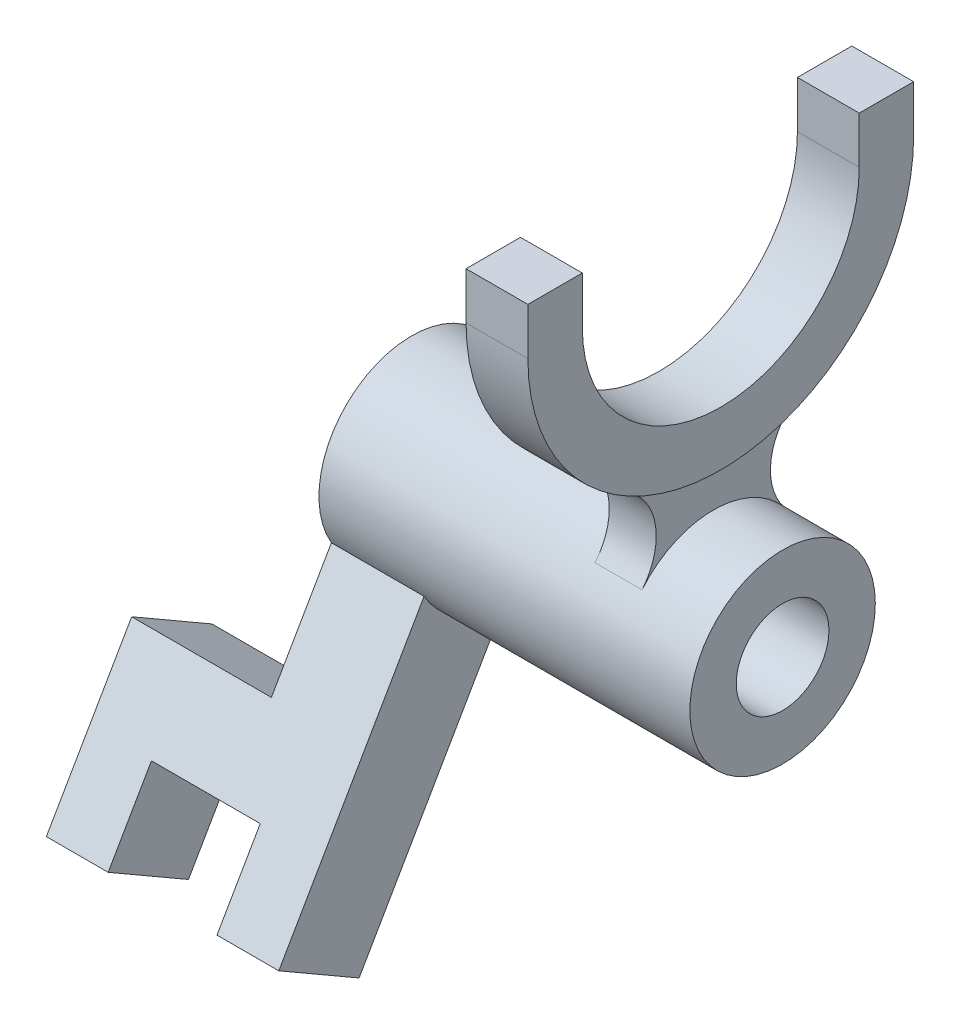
ISO-10303-21;
HEADER;
FILE_DESCRIPTION(('STEP AP214'),'2;1');
FILE_NAME('part.step','',(''),(''),'','','');
FILE_SCHEMA(('AUTOMOTIVE_DESIGN { 1 0 10303 214 1 1 1 1 }'));
ENDSEC;
DATA;
#1=APPLICATION_CONTEXT('core data for automotive mechanical design processes');
#2=APPLICATION_PROTOCOL_DEFINITION('international standard','automotive_design',2000,#1);
#3=PRODUCT_CONTEXT('',#1,'mechanical');
#4=PRODUCT('Part','Part','',(#3));
#5=PRODUCT_RELATED_PRODUCT_CATEGORY('part','',(#4));
#6=PRODUCT_DEFINITION_FORMATION('','',#4);
#7=PRODUCT_DEFINITION_CONTEXT('part definition',#1,'design');
#8=PRODUCT_DEFINITION('design','',#6,#7);
#9=PRODUCT_DEFINITION_SHAPE('','',#8);
#10=(LENGTH_UNIT() NAMED_UNIT(*) SI_UNIT(.MILLI.,.METRE.));
#11=(NAMED_UNIT(*) PLANE_ANGLE_UNIT() SI_UNIT($,.RADIAN.));
#12=(NAMED_UNIT(*) SI_UNIT($,.STERADIAN.) SOLID_ANGLE_UNIT());
#13=UNCERTAINTY_MEASURE_WITH_UNIT(LENGTH_MEASURE(1.E-05),#10,'distance_accuracy_value','');
#14=(GEOMETRIC_REPRESENTATION_CONTEXT(3) GLOBAL_UNCERTAINTY_ASSIGNED_CONTEXT((#13)) GLOBAL_UNIT_ASSIGNED_CONTEXT((#10,
#11,#12)) REPRESENTATION_CONTEXT('',''));
#15=CARTESIAN_POINT('',(0.,0.,0.));
#16=DIRECTION('',(0.,0.,1.));
#17=DIRECTION('',(1.,0.,0.));
#18=AXIS2_PLACEMENT_3D('',#15,#16,#17);
#19=CARTESIAN_POINT('',(-57.15,0.,0.));
#20=DIRECTION('',(1.,0.,0.));
#21=DIRECTION('',(0.,0.,-1.));
#22=AXIS2_PLACEMENT_3D('',#19,#20,#21);
#23=CYLINDRICAL_SURFACE('',#22,19.05);
#24=DIRECTION('',(1.,0.,0.));
#25=VECTOR('',#24,1.);
#26=CARTESIAN_POINT('',(-57.15,-9.52499999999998,16.4977839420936));
#27=LINE('',#26,#25);
#28=CARTESIAN_POINT('',(-38.1,-9.52499999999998,16.4977839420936));
#29=VERTEX_POINT('',#28);
#30=CARTESIAN_POINT('',(-57.15,-9.52499999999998,16.4977839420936));
#31=VERTEX_POINT('',#30);
#32=EDGE_CURVE('E190',#29,#31,#27,.F.);
#33=ORIENTED_EDGE('',*,*,#32,.F.);
#34=CARTESIAN_POINT('',(-38.1,0.,0.));
#35=DIRECTION('',(-1.,0.,0.));
#36=DIRECTION('',(0.,-1.,0.));
#37=AXIS2_PLACEMENT_3D('',#34,#35,#36);
#38=CIRCLE('',#37,19.05);
#39=CARTESIAN_POINT('',(-38.1,-19.05,0.));
#40=VERTEX_POINT('',#39);
#41=EDGE_CURVE('E199',#29,#40,#38,.F.);
#42=ORIENTED_EDGE('',*,*,#41,.T.);
#43=DIRECTION('',(1.,0.,0.));
#44=VECTOR('',#43,1.);
#45=CARTESIAN_POINT('',(-57.15,-19.05,0.));
#46=LINE('',#45,#44);
#47=CARTESIAN_POINT('',(-57.15,-19.05,0.));
#48=VERTEX_POINT('',#47);
#49=EDGE_CURVE('E259',#40,#48,#46,.F.);
#50=ORIENTED_EDGE('',*,*,#49,.T.);
#51=CARTESIAN_POINT('',(-57.15,0.,0.));
#52=DIRECTION('',(1.,0.,0.));
#53=DIRECTION('',(0.,0.,-1.));
#54=AXIS2_PLACEMENT_3D('',#51,#52,#53);
#55=CIRCLE('',#54,19.05);
#56=EDGE_CURVE('E11',#48,#31,#55,.T.);
#57=ORIENTED_EDGE('',*,*,#56,.T.);
#58=EDGE_LOOP('',(#33,#42,#50,#57));
#59=FACE_BOUND('',#58,.T.);
#60=CARTESIAN_POINT('',(4.826,0.,0.));
#61=DIRECTION('',(-1.,0.,0.));
#62=DIRECTION('',(0.,0.,-1.));
#63=AXIS2_PLACEMENT_3D('',#60,#61,#62);
#64=CIRCLE('',#63,19.05);
#65=CARTESIAN_POINT('',(4.826,12.1666969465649,14.6585806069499));
#66=VERTEX_POINT('',#65);
#67=CARTESIAN_POINT('',(4.826,12.1666969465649,-14.6585806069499));
#68=VERTEX_POINT('',#67);
#69=EDGE_CURVE('E326',#66,#68,#64,.T.);
#70=ORIENTED_EDGE('',*,*,#69,.F.);
#71=DIRECTION('',(-1.,0.,0.));
#72=VECTOR('',#71,1.);
#73=CARTESIAN_POINT('',(4.826,12.1666969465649,14.6585806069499));
#74=LINE('',#73,#72);
#75=CARTESIAN_POINT('',(-4.826,12.1666969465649,14.6585806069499));
#76=VERTEX_POINT('',#75);
#77=EDGE_CURVE('E349',#66,#76,#74,.T.);
#78=ORIENTED_EDGE('',*,*,#77,.T.);
#79=CARTESIAN_POINT('',(-4.826,0.,0.));
#80=DIRECTION('',(-1.,0.,0.));
#81=DIRECTION('',(0.,0.,-1.));
#82=AXIS2_PLACEMENT_3D('',#79,#80,#81);
#83=CIRCLE('',#82,19.05);
#84=CARTESIAN_POINT('',(-4.826,12.1666969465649,-14.6585806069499));
#85=VERTEX_POINT('',#84);
#86=EDGE_CURVE('E336',#76,#85,#83,.T.);
#87=ORIENTED_EDGE('',*,*,#86,.T.);
#88=DIRECTION('',(-1.,0.,0.));
#89=VECTOR('',#88,1.);
#90=CARTESIAN_POINT('',(4.826,12.1666969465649,-14.6585806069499));
#91=LINE('',#90,#89);
#92=EDGE_CURVE('E347',#68,#85,#91,.T.);
#93=ORIENTED_EDGE('',*,*,#92,.F.);
#94=EDGE_LOOP('',(#70,#78,#87,#93));
#95=FACE_BOUND('',#94,.T.);
#96=CARTESIAN_POINT('',(19.05,0.,0.));
#97=DIRECTION('',(1.,0.,0.));
#98=DIRECTION('',(0.,0.,-1.));
#99=AXIS2_PLACEMENT_3D('',#96,#97,#98);
#100=CIRCLE('',#99,19.05);
#101=CARTESIAN_POINT('',(19.05,0.,-19.05));
#102=VERTEX_POINT('',#101);
#103=EDGE_CURVE('E355',#102,#102,#100,.T.);
#104=ORIENTED_EDGE('',*,*,#103,.F.);
#105=EDGE_LOOP('',(#104));
#106=FACE_BOUND('',#105,.T.);
#107=ADVANCED_FACE('F35',(#59,#95,#106),#23,.T.);
#108=CARTESIAN_POINT('',(-57.15,0.,0.));
#109=DIRECTION('',(1.,0.,0.));
#110=DIRECTION('',(0.,0.,-1.));
#111=AXIS2_PLACEMENT_3D('',#108,#109,#110);
#112=PLANE('',#111);
#113=CARTESIAN_POINT('',(-57.15,0.,0.));
#114=DIRECTION('',(1.,0.,0.));
#115=DIRECTION('',(0.,0.,-1.));
#116=AXIS2_PLACEMENT_3D('',#113,#114,#115);
#117=CIRCLE('',#116,9.525);
#118=CARTESIAN_POINT('',(-57.15,0.,-9.525));
#119=VERTEX_POINT('',#118);
#120=EDGE_CURVE('E42',#119,#119,#117,.T.);
#121=ORIENTED_EDGE('',*,*,#120,.T.);
#122=EDGE_LOOP('',(#121));
#123=FACE_BOUND('',#122,.T.);
#124=ORIENTED_EDGE('',*,*,#56,.F.);
#125=DIRECTION('',(0.,-0.866025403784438,0.500000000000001));
#126=VECTOR('',#125,1.);
#127=CARTESIAN_POINT('',(-57.15,-13.0113919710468,-3.48639197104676));
#128=LINE('',#127,#126);
#129=CARTESIAN_POINT('',(-57.15,-40.3977133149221,12.3251080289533));
#130=VERTEX_POINT('',#129);
#131=EDGE_CURVE('E49',#48,#130,#128,.T.);
#132=ORIENTED_EDGE('',*,*,#131,.T.);
#133=DIRECTION('',(0.,-0.500000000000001,-0.866025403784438));
#134=VECTOR('',#133,1.);
#135=CARTESIAN_POINT('',(-57.15,-30.872713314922,28.8228919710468));
#136=LINE('',#135,#134);
#137=CARTESIAN_POINT('',(-57.15,-30.872713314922,28.8228919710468));
#138=VERTEX_POINT('',#137);
#139=EDGE_CURVE('E196',#138,#130,#136,.T.);
#140=ORIENTED_EDGE('',*,*,#139,.F.);
#141=DIRECTION('',(0.,-0.866025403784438,0.500000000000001));
#142=VECTOR('',#141,1.);
#143=CARTESIAN_POINT('',(-57.15,-3.48639197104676,13.0113919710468));
#144=LINE('',#143,#142);
#145=EDGE_CURVE('E182',#31,#138,#144,.T.);
#146=ORIENTED_EDGE('',*,*,#145,.F.);
#147=EDGE_LOOP('',(#124,#132,#140,#146));
#148=FACE_BOUND('',#147,.T.);
#149=ADVANCED_FACE('F197',(#123,#148),#112,.F.);
#150=CARTESIAN_POINT('',(-57.15,0.,0.));
#151=DIRECTION('',(1.,0.,0.));
#152=DIRECTION('',(0.,0.,-1.));
#153=AXIS2_PLACEMENT_3D('',#150,#151,#152);
#154=CYLINDRICAL_SURFACE('',#153,9.525);
#155=ORIENTED_EDGE('',*,*,#120,.F.);
#156=EDGE_LOOP('',(#155));
#157=FACE_BOUND('',#156,.T.);
#158=CARTESIAN_POINT('',(19.05,0.,0.));
#159=DIRECTION('',(1.,0.,0.));
#160=DIRECTION('',(0.,0.,-1.));
#161=AXIS2_PLACEMENT_3D('',#158,#159,#160);
#162=CIRCLE('',#161,9.525);
#163=CARTESIAN_POINT('',(19.05,0.,-9.525));
#164=VERTEX_POINT('',#163);
#165=EDGE_CURVE('E352',#164,#164,#162,.T.);
#166=ORIENTED_EDGE('',*,*,#165,.T.);
#167=EDGE_LOOP('',(#166));
#168=FACE_BOUND('',#167,.T.);
#169=ADVANCED_FACE('F361',(#157,#168),#154,.F.);
#170=CARTESIAN_POINT('',(19.05,0.,0.));
#171=DIRECTION('',(1.,0.,0.));
#172=DIRECTION('',(0.,0.,-1.));
#173=AXIS2_PLACEMENT_3D('',#170,#171,#172);
#174=PLANE('',#173);
#175=ORIENTED_EDGE('',*,*,#103,.T.);
#176=EDGE_LOOP('',(#175));
#177=FACE_BOUND('',#176,.T.);
#178=ORIENTED_EDGE('',*,*,#165,.F.);
#179=EDGE_LOOP('',(#178));
#180=FACE_BOUND('',#179,.T.);
#181=ADVANCED_FACE('F364',(#177,#180),#174,.T.);
#182=CARTESIAN_POINT('',(4.826,20.2778282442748,24.4309676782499));
#183=DIRECTION('',(-1.,0.,0.));
#184=DIRECTION('',(0.,0.,1.));
#185=AXIS2_PLACEMENT_3D('',#182,#183,#184);
#186=CYLINDRICAL_SURFACE('',#185,12.7);
#187=CARTESIAN_POINT('',(-4.826,20.2778282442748,24.4309676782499));
#188=DIRECTION('',(-1.,0.,0.));
#189=DIRECTION('',(0.,0.,-1.));
#190=AXIS2_PLACEMENT_3D('',#187,#188,#189);
#191=CIRCLE('',#190,12.7);
#192=CARTESIAN_POINT('',(-4.826,31.5084524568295,18.5011211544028));
#193=VERTEX_POINT('',#192);
#194=EDGE_CURVE('E323',#193,#76,#191,.T.);
#195=ORIENTED_EDGE('',*,*,#194,.T.);
#196=ORIENTED_EDGE('',*,*,#77,.F.);
#197=CARTESIAN_POINT('',(4.826,20.2778282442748,24.4309676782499));
#198=DIRECTION('',(-1.,0.,0.));
#199=DIRECTION('',(0.,0.,-1.));
#200=AXIS2_PLACEMENT_3D('',#197,#198,#199);
#201=CIRCLE('',#200,12.7);
#202=CARTESIAN_POINT('',(4.826,31.5084524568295,18.5011211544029));
#203=VERTEX_POINT('',#202);
#204=EDGE_CURVE('E324',#203,#66,#201,.T.);
#205=ORIENTED_EDGE('',*,*,#204,.F.);
#206=DIRECTION('',(-1.,0.,0.));
#207=VECTOR('',#206,1.);
#208=CARTESIAN_POINT('',(4.826,31.5084524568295,18.5011211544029));
#209=LINE('',#208,#207);
#210=EDGE_CURVE('E333',#203,#193,#209,.T.);
#211=ORIENTED_EDGE('',*,*,#210,.T.);
#212=EDGE_LOOP('',(#195,#196,#205,#211));
#213=FACE_BOUND('',#212,.T.);
#214=ADVANCED_FACE('F369',(#213),#186,.F.);
#215=CARTESIAN_POINT('',(4.826,20.2778282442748,-24.4309676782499));
#216=DIRECTION('',(-1.,0.,0.));
#217=DIRECTION('',(0.,0.,1.));
#218=AXIS2_PLACEMENT_3D('',#215,#216,#217);
#219=CYLINDRICAL_SURFACE('',#218,12.7);
#220=CARTESIAN_POINT('',(-4.826,20.2778282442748,-24.4309676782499));
#221=DIRECTION('',(-1.,0.,0.));
#222=DIRECTION('',(0.,0.,1.));
#223=AXIS2_PLACEMENT_3D('',#220,#221,#222);
#224=CIRCLE('',#223,12.7);
#225=CARTESIAN_POINT('',(-4.826,31.5084524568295,-18.5011211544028));
#226=VERTEX_POINT('',#225);
#227=EDGE_CURVE('E57',#85,#226,#224,.T.);
#228=ORIENTED_EDGE('',*,*,#227,.T.);
#229=DIRECTION('',(-1.,0.,0.));
#230=VECTOR('',#229,1.);
#231=CARTESIAN_POINT('',(4.826,31.5084524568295,-18.5011211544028));
#232=LINE('',#231,#230);
#233=CARTESIAN_POINT('',(4.826,31.5084524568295,-18.5011211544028));
#234=VERTEX_POINT('',#233);
#235=EDGE_CURVE('E344',#234,#226,#232,.T.);
#236=ORIENTED_EDGE('',*,*,#235,.F.);
#237=CARTESIAN_POINT('',(4.826,20.2778282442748,-24.4309676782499));
#238=DIRECTION('',(-1.,0.,0.));
#239=DIRECTION('',(0.,0.,1.));
#240=AXIS2_PLACEMENT_3D('',#237,#238,#239);
#241=CIRCLE('',#240,12.7);
#242=EDGE_CURVE('E329',#68,#234,#241,.T.);
#243=ORIENTED_EDGE('',*,*,#242,.F.);
#244=ORIENTED_EDGE('',*,*,#92,.T.);
#245=EDGE_LOOP('',(#228,#236,#243,#244));
#246=FACE_BOUND('',#245,.T.);
#247=ADVANCED_FACE('F376',(#246),#219,.F.);
#248=CARTESIAN_POINT('',(4.826,43.4129141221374,12.2154838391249));
#249=DIRECTION('',(1.,0.,0.));
#250=DIRECTION('',(0.,0.,-1.));
#251=AXIS2_PLACEMENT_3D('',#248,#249,#250);
#252=PLANE('',#251);
#253=ORIENTED_EDGE('',*,*,#204,.T.);
#254=ORIENTED_EDGE('',*,*,#69,.T.);
#255=ORIENTED_EDGE('',*,*,#242,.T.);
#256=CARTESIAN_POINT('',(4.826,66.548,0.));
#257=DIRECTION('',(-1.,0.,0.));
#258=DIRECTION('',(0.,0.,-1.));
#259=AXIS2_PLACEMENT_3D('',#256,#257,#258);
#260=CIRCLE('',#259,39.624);
#261=EDGE_CURVE('E331',#234,#203,#260,.T.);
#262=ORIENTED_EDGE('',*,*,#261,.T.);
#263=EDGE_LOOP('',(#253,#254,#255,#262));
#264=FACE_BOUND('',#263,.T.);
#265=ADVANCED_FACE('F394',(#264),#252,.T.);
#266=CARTESIAN_POINT('',(-4.826,43.4129141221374,12.2154838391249));
#267=DIRECTION('',(1.,0.,0.));
#268=DIRECTION('',(0.,0.,-1.));
#269=AXIS2_PLACEMENT_3D('',#266,#267,#268);
#270=PLANE('',#269);
#271=ORIENTED_EDGE('',*,*,#194,.F.);
#272=CARTESIAN_POINT('',(-4.826,66.548,0.));
#273=DIRECTION('',(-1.,0.,0.));
#274=DIRECTION('',(0.,0.,-1.));
#275=AXIS2_PLACEMENT_3D('',#272,#273,#274);
#276=CIRCLE('',#275,39.624);
#277=EDGE_CURVE('E327',#226,#193,#276,.T.);
#278=ORIENTED_EDGE('',*,*,#277,.F.);
#279=ORIENTED_EDGE('',*,*,#227,.F.);
#280=ORIENTED_EDGE('',*,*,#86,.F.);
#281=EDGE_LOOP('',(#271,#278,#279,#280));
#282=FACE_BOUND('',#281,.T.);
#283=ADVANCED_FACE('F403',(#282),#270,.F.);
#284=CARTESIAN_POINT('',(6.35,66.548,28.448));
#285=DIRECTION('',(0.,0.,1.));
#286=DIRECTION('',(1.,0.,0.));
#287=AXIS2_PLACEMENT_3D('',#284,#285,#286);
#288=PLANE('',#287);
#289=DIRECTION('',(0.,1.,0.));
#290=VECTOR('',#289,1.);
#291=CARTESIAN_POINT('',(-6.35,66.548,28.448));
#292=LINE('',#291,#290);
#293=CARTESIAN_POINT('',(-6.35,66.548,28.448));
#294=VERTEX_POINT('',#293);
#295=CARTESIAN_POINT('',(-6.35,76.2,28.448));
#296=VERTEX_POINT('',#295);
#297=EDGE_CURVE('E262',#294,#296,#292,.T.);
#298=ORIENTED_EDGE('',*,*,#297,.T.);
#299=DIRECTION('',(-1.,0.,0.));
#300=VECTOR('',#299,1.);
#301=CARTESIAN_POINT('',(6.35,76.2,28.448));
#302=LINE('',#301,#300);
#303=CARTESIAN_POINT('',(6.35,76.2,28.448));
#304=VERTEX_POINT('',#303);
#305=EDGE_CURVE('E321',#304,#296,#302,.T.);
#306=ORIENTED_EDGE('',*,*,#305,.F.);
#307=DIRECTION('',(0.,1.,0.));
#308=VECTOR('',#307,1.);
#309=CARTESIAN_POINT('',(6.35,66.548,28.448));
#310=LINE('',#309,#308);
#311=CARTESIAN_POINT('',(6.35,66.548,28.448));
#312=VERTEX_POINT('',#311);
#313=EDGE_CURVE('E263',#312,#304,#310,.T.);
#314=ORIENTED_EDGE('',*,*,#313,.F.);
#315=DIRECTION('',(-1.,0.,0.));
#316=VECTOR('',#315,1.);
#317=CARTESIAN_POINT('',(6.35,66.548,28.448));
#318=LINE('',#317,#316);
#319=EDGE_CURVE('E285',#312,#294,#318,.T.);
#320=ORIENTED_EDGE('',*,*,#319,.T.);
#321=EDGE_LOOP('',(#298,#306,#314,#320));
#322=FACE_BOUND('',#321,.T.);
#323=ADVANCED_FACE('F405',(#322),#288,.F.);
#324=CARTESIAN_POINT('',(6.35,76.2,39.624));
#325=DIRECTION('',(0.,1.,0.));
#326=DIRECTION('',(0.,0.,1.));
#327=AXIS2_PLACEMENT_3D('',#324,#325,#326);
#328=PLANE('',#327);
#329=DIRECTION('',(0.,0.,-1.));
#330=VECTOR('',#329,1.);
#331=CARTESIAN_POINT('',(-6.35,76.2,39.624));
#332=LINE('',#331,#330);
#333=CARTESIAN_POINT('',(-6.35,76.2,39.624));
#334=VERTEX_POINT('',#333);
#335=EDGE_CURVE('E288',#334,#296,#332,.T.);
#336=ORIENTED_EDGE('',*,*,#335,.F.);
#337=DIRECTION('',(-1.,0.,0.));
#338=VECTOR('',#337,1.);
#339=CARTESIAN_POINT('',(6.35,76.2,39.624));
#340=LINE('',#339,#338);
#341=CARTESIAN_POINT('',(6.35,76.2,39.624));
#342=VERTEX_POINT('',#341);
#343=EDGE_CURVE('E319',#342,#334,#340,.T.);
#344=ORIENTED_EDGE('',*,*,#343,.F.);
#345=DIRECTION('',(0.,0.,-1.));
#346=VECTOR('',#345,1.);
#347=CARTESIAN_POINT('',(6.35,76.2,39.624));
#348=LINE('',#347,#346);
#349=EDGE_CURVE('E265',#342,#304,#348,.T.);
#350=ORIENTED_EDGE('',*,*,#349,.T.);
#351=ORIENTED_EDGE('',*,*,#305,.T.);
#352=EDGE_LOOP('',(#336,#344,#350,#351));
#353=FACE_BOUND('',#352,.T.);
#354=ADVANCED_FACE('F411',(#353),#328,.T.);
#355=CARTESIAN_POINT('',(6.35,66.548,39.624));
#356=DIRECTION('',(0.,0.,1.));
#357=DIRECTION('',(1.,0.,0.));
#358=AXIS2_PLACEMENT_3D('',#355,#356,#357);
#359=PLANE('',#358);
#360=DIRECTION('',(0.,1.,0.));
#361=VECTOR('',#360,1.);
#362=CARTESIAN_POINT('',(-6.35,66.548,39.624));
#363=LINE('',#362,#361);
#364=CARTESIAN_POINT('',(-6.35,66.548,39.624));
#365=VERTEX_POINT('',#364);
#366=EDGE_CURVE('E291',#365,#334,#363,.T.);
#367=ORIENTED_EDGE('',*,*,#366,.F.);
#368=DIRECTION('',(-1.,0.,0.));
#369=VECTOR('',#368,1.);
#370=CARTESIAN_POINT('',(6.35,66.548,39.624));
#371=LINE('',#370,#369);
#372=CARTESIAN_POINT('',(6.35,66.548,39.624));
#373=VERTEX_POINT('',#372);
#374=EDGE_CURVE('E317',#373,#365,#371,.T.);
#375=ORIENTED_EDGE('',*,*,#374,.F.);
#376=DIRECTION('',(0.,1.,0.));
#377=VECTOR('',#376,1.);
#378=CARTESIAN_POINT('',(6.35,66.548,39.624));
#379=LINE('',#378,#377);
#380=EDGE_CURVE('E269',#373,#342,#379,.T.);
#381=ORIENTED_EDGE('',*,*,#380,.T.);
#382=ORIENTED_EDGE('',*,*,#343,.T.);
#383=EDGE_LOOP('',(#367,#375,#381,#382));
#384=FACE_BOUND('',#383,.T.);
#385=ADVANCED_FACE('F446',(#384),#359,.T.);
#386=CARTESIAN_POINT('',(6.35,66.548,0.));
#387=DIRECTION('',(-1.,0.,0.));
#388=DIRECTION('',(0.,0.,1.));
#389=AXIS2_PLACEMENT_3D('',#386,#387,#388);
#390=CYLINDRICAL_SURFACE('',#389,39.624);
#391=ORIENTED_EDGE('',*,*,#210,.F.);
#392=ORIENTED_EDGE('',*,*,#261,.F.);
#393=ORIENTED_EDGE('',*,*,#235,.T.);
#394=ORIENTED_EDGE('',*,*,#277,.T.);
#395=EDGE_LOOP('',(#391,#392,#393,#394));
#396=FACE_BOUND('',#395,.T.);
#397=CARTESIAN_POINT('',(-6.35,66.548,0.));
#398=DIRECTION('',(-1.,0.,0.));
#399=DIRECTION('',(0.,0.,-1.));
#400=AXIS2_PLACEMENT_3D('',#397,#398,#399);
#401=CIRCLE('',#400,39.624);
#402=CARTESIAN_POINT('',(-6.35,66.548,-39.624));
#403=VERTEX_POINT('',#402);
#404=EDGE_CURVE('E294',#403,#365,#401,.T.);
#405=ORIENTED_EDGE('',*,*,#404,.F.);
#406=DIRECTION('',(-1.,0.,0.));
#407=VECTOR('',#406,1.);
#408=CARTESIAN_POINT('',(6.35,66.548,-39.624));
#409=LINE('',#408,#407);
#410=CARTESIAN_POINT('',(6.35,66.548,-39.624));
#411=VERTEX_POINT('',#410);
#412=EDGE_CURVE('E315',#411,#403,#409,.T.);
#413=ORIENTED_EDGE('',*,*,#412,.F.);
#414=CARTESIAN_POINT('',(6.35,66.548,0.));
#415=DIRECTION('',(-1.,0.,0.));
#416=DIRECTION('',(0.,0.,-1.));
#417=AXIS2_PLACEMENT_3D('',#414,#415,#416);
#418=CIRCLE('',#417,39.624);
#419=EDGE_CURVE('E272',#411,#373,#418,.T.);
#420=ORIENTED_EDGE('',*,*,#419,.T.);
#421=ORIENTED_EDGE('',*,*,#374,.T.);
#422=EDGE_LOOP('',(#405,#413,#420,#421));
#423=FACE_BOUND('',#422,.T.);
#424=ADVANCED_FACE('F401',(#396,#423),#390,.T.);
#425=CARTESIAN_POINT('',(6.35,66.548,-39.624));
#426=DIRECTION('',(0.,0.,-1.));
#427=DIRECTION('',(-1.,0.,0.));
#428=AXIS2_PLACEMENT_3D('',#425,#426,#427);
#429=PLANE('',#428);
#430=DIRECTION('',(0.,-1.,0.));
#431=VECTOR('',#430,1.);
#432=CARTESIAN_POINT('',(-6.35,66.548,-39.624));
#433=LINE('',#432,#431);
#434=CARTESIAN_POINT('',(-6.35,76.2,-39.624));
#435=VERTEX_POINT('',#434);
#436=EDGE_CURVE('E297',#435,#403,#433,.T.);
#437=ORIENTED_EDGE('',*,*,#436,.F.);
#438=DIRECTION('',(-1.,0.,0.));
#439=VECTOR('',#438,1.);
#440=CARTESIAN_POINT('',(6.35,76.2,-39.624));
#441=LINE('',#440,#439);
#442=CARTESIAN_POINT('',(6.35,76.2,-39.624));
#443=VERTEX_POINT('',#442);
#444=EDGE_CURVE('E313',#443,#435,#441,.T.);
#445=ORIENTED_EDGE('',*,*,#444,.F.);
#446=DIRECTION('',(0.,-1.,0.));
#447=VECTOR('',#446,1.);
#448=CARTESIAN_POINT('',(6.35,66.548,-39.624));
#449=LINE('',#448,#447);
#450=EDGE_CURVE('E275',#443,#411,#449,.T.);
#451=ORIENTED_EDGE('',*,*,#450,.T.);
#452=ORIENTED_EDGE('',*,*,#412,.T.);
#453=EDGE_LOOP('',(#437,#445,#451,#452));
#454=FACE_BOUND('',#453,.T.);
#455=ADVANCED_FACE('F465',(#454),#429,.T.);
#456=CARTESIAN_POINT('',(6.35,76.2,-28.448));
#457=DIRECTION('',(0.,1.,0.));
#458=DIRECTION('',(0.,0.,1.));
#459=AXIS2_PLACEMENT_3D('',#456,#457,#458);
#460=PLANE('',#459);
#461=DIRECTION('',(0.,0.,-1.));
#462=VECTOR('',#461,1.);
#463=CARTESIAN_POINT('',(-6.35,76.2,-28.448));
#464=LINE('',#463,#462);
#465=CARTESIAN_POINT('',(-6.35,76.2,-28.448));
#466=VERTEX_POINT('',#465);
#467=EDGE_CURVE('E300',#466,#435,#464,.T.);
#468=ORIENTED_EDGE('',*,*,#467,.F.);
#469=DIRECTION('',(-1.,0.,0.));
#470=VECTOR('',#469,1.);
#471=CARTESIAN_POINT('',(6.35,76.2,-28.448));
#472=LINE('',#471,#470);
#473=CARTESIAN_POINT('',(6.35,76.2,-28.448));
#474=VERTEX_POINT('',#473);
#475=EDGE_CURVE('E311',#474,#466,#472,.T.);
#476=ORIENTED_EDGE('',*,*,#475,.F.);
#477=DIRECTION('',(0.,0.,-1.));
#478=VECTOR('',#477,1.);
#479=CARTESIAN_POINT('',(6.35,76.2,-28.448));
#480=LINE('',#479,#478);
#481=EDGE_CURVE('E278',#474,#443,#480,.T.);
#482=ORIENTED_EDGE('',*,*,#481,.T.);
#483=ORIENTED_EDGE('',*,*,#444,.T.);
#484=EDGE_LOOP('',(#468,#476,#482,#483));
#485=FACE_BOUND('',#484,.T.);
#486=ADVANCED_FACE('F474',(#485),#460,.T.);
#487=CARTESIAN_POINT('',(6.35,66.548,-28.448));
#488=DIRECTION('',(0.,0.,-1.));
#489=DIRECTION('',(-1.,0.,0.));
#490=AXIS2_PLACEMENT_3D('',#487,#488,#489);
#491=PLANE('',#490);
#492=DIRECTION('',(0.,1.,0.));
#493=VECTOR('',#492,1.);
#494=CARTESIAN_POINT('',(-6.35,66.548,-28.448));
#495=LINE('',#494,#493);
#496=CARTESIAN_POINT('',(-6.35,66.548,-28.448));
#497=VERTEX_POINT('',#496);
#498=EDGE_CURVE('E303',#466,#497,#495,.F.);
#499=ORIENTED_EDGE('',*,*,#498,.T.);
#500=DIRECTION('',(-1.,0.,0.));
#501=VECTOR('',#500,1.);
#502=CARTESIAN_POINT('',(6.35,66.548,-28.448));
#503=LINE('',#502,#501);
#504=CARTESIAN_POINT('',(6.35,66.548,-28.448));
#505=VERTEX_POINT('',#504);
#506=EDGE_CURVE('E308',#505,#497,#503,.T.);
#507=ORIENTED_EDGE('',*,*,#506,.F.);
#508=DIRECTION('',(0.,1.,0.));
#509=VECTOR('',#508,1.);
#510=CARTESIAN_POINT('',(6.35,66.548,-28.448));
#511=LINE('',#510,#509);
#512=EDGE_CURVE('E281',#474,#505,#511,.F.);
#513=ORIENTED_EDGE('',*,*,#512,.F.);
#514=ORIENTED_EDGE('',*,*,#475,.T.);
#515=EDGE_LOOP('',(#499,#507,#513,#514));
#516=FACE_BOUND('',#515,.T.);
#517=ADVANCED_FACE('F484',(#516),#491,.F.);
#518=CARTESIAN_POINT('',(6.35,66.548,0.));
#519=DIRECTION('',(-1.,0.,0.));
#520=DIRECTION('',(0.,0.,1.));
#521=AXIS2_PLACEMENT_3D('',#518,#519,#520);
#522=CYLINDRICAL_SURFACE('',#521,28.448);
#523=CARTESIAN_POINT('',(-6.35,66.548,0.));
#524=DIRECTION('',(1.,0.,0.));
#525=DIRECTION('',(0.,0.,-1.));
#526=AXIS2_PLACEMENT_3D('',#523,#524,#525);
#527=CIRCLE('',#526,28.448);
#528=EDGE_CURVE('E266',#497,#294,#527,.F.);
#529=ORIENTED_EDGE('',*,*,#528,.T.);
#530=ORIENTED_EDGE('',*,*,#319,.F.);
#531=CARTESIAN_POINT('',(6.35,66.548,0.));
#532=DIRECTION('',(1.,0.,0.));
#533=DIRECTION('',(0.,0.,-1.));
#534=AXIS2_PLACEMENT_3D('',#531,#532,#533);
#535=CIRCLE('',#534,28.448);
#536=EDGE_CURVE('E283',#505,#312,#535,.F.);
#537=ORIENTED_EDGE('',*,*,#536,.F.);
#538=ORIENTED_EDGE('',*,*,#506,.T.);
#539=EDGE_LOOP('',(#529,#530,#537,#538));
#540=FACE_BOUND('',#539,.T.);
#541=ADVANCED_FACE('F494',(#540),#522,.F.);
#542=CARTESIAN_POINT('',(6.35,66.548,0.));
#543=DIRECTION('',(-1.,0.,0.));
#544=DIRECTION('',(0.,0.,1.));
#545=AXIS2_PLACEMENT_3D('',#542,#543,#544);
#546=PLANE('',#545);
#547=ORIENTED_EDGE('',*,*,#313,.T.);
#548=ORIENTED_EDGE('',*,*,#349,.F.);
#549=ORIENTED_EDGE('',*,*,#380,.F.);
#550=ORIENTED_EDGE('',*,*,#419,.F.);
#551=ORIENTED_EDGE('',*,*,#450,.F.);
#552=ORIENTED_EDGE('',*,*,#481,.F.);
#553=ORIENTED_EDGE('',*,*,#512,.T.);
#554=ORIENTED_EDGE('',*,*,#536,.T.);
#555=EDGE_LOOP('',(#547,#548,#549,#550,#551,#552,#553,#554));
#556=FACE_BOUND('',#555,.T.);
#557=ADVANCED_FACE('F504',(#556),#546,.F.);
#558=CARTESIAN_POINT('',(-6.35,66.548,0.));
#559=DIRECTION('',(-1.,0.,0.));
#560=DIRECTION('',(0.,0.,1.));
#561=AXIS2_PLACEMENT_3D('',#558,#559,#560);
#562=PLANE('',#561);
#563=ORIENTED_EDGE('',*,*,#297,.F.);
#564=ORIENTED_EDGE('',*,*,#528,.F.);
#565=ORIENTED_EDGE('',*,*,#498,.F.);
#566=ORIENTED_EDGE('',*,*,#467,.T.);
#567=ORIENTED_EDGE('',*,*,#436,.T.);
#568=ORIENTED_EDGE('',*,*,#404,.T.);
#569=ORIENTED_EDGE('',*,*,#366,.T.);
#570=ORIENTED_EDGE('',*,*,#335,.T.);
#571=EDGE_LOOP('',(#563,#564,#565,#566,#567,#568,#569,#570));
#572=FACE_BOUND('',#571,.T.);
#573=ADVANCED_FACE('F513',(#572),#562,.T.);
#574=CARTESIAN_POINT('',(-57.15,-30.872713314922,28.8228919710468));
#575=DIRECTION('',(0.,-0.866025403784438,0.500000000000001));
#576=DIRECTION('',(0.,-0.500000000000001,-0.866025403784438));
#577=AXIS2_PLACEMENT_3D('',#574,#575,#576);
#578=PLANE('',#577);
#579=DIRECTION('',(-1.,0.,0.));
#580=VECTOR('',#579,1.);
#581=CARTESIAN_POINT('',(-57.15,-40.3977133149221,12.3251080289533));
#582=LINE('',#581,#580);
#583=CARTESIAN_POINT('',(-85.852,-40.3977133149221,12.3251080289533));
#584=VERTEX_POINT('',#583);
#585=EDGE_CURVE('E223',#130,#584,#582,.T.);
#586=ORIENTED_EDGE('',*,*,#585,.T.);
#587=DIRECTION('',(0.,-0.500000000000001,-0.866025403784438));
#588=VECTOR('',#587,1.);
#589=CARTESIAN_POINT('',(-85.852,-30.8727133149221,28.8228919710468));
#590=LINE('',#589,#588);
#591=CARTESIAN_POINT('',(-85.852,-30.8727133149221,28.8228919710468));
#592=VERTEX_POINT('',#591);
#593=EDGE_CURVE('E200',#592,#584,#590,.T.);
#594=ORIENTED_EDGE('',*,*,#593,.F.);
#595=DIRECTION('',(-1.,0.,0.));
#596=VECTOR('',#595,1.);
#597=CARTESIAN_POINT('',(-57.15,-30.872713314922,28.8228919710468));
#598=LINE('',#597,#596);
#599=EDGE_CURVE('E187',#138,#592,#598,.T.);
#600=ORIENTED_EDGE('',*,*,#599,.F.);
#601=ORIENTED_EDGE('',*,*,#139,.T.);
#602=EDGE_LOOP('',(#586,#594,#600,#601));
#603=FACE_BOUND('',#602,.T.);
#604=ADVANCED_FACE('F202',(#603),#578,.F.);
#605=CARTESIAN_POINT('',(-85.852,-30.8727133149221,28.8228919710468));
#606=DIRECTION('',(1.,0.,0.));
#607=DIRECTION('',(0.,1.,0.));
#608=AXIS2_PLACEMENT_3D('',#605,#606,#607);
#609=PLANE('',#608);
#610=DIRECTION('',(0.,-0.866025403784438,0.500000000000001));
#611=VECTOR('',#610,1.);
#612=CARTESIAN_POINT('',(-85.852,-40.3977133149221,12.3251080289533));
#613=LINE('',#612,#611);
#614=CARTESIAN_POINT('',(-85.852,-70.7536357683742,29.8511080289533));
#615=VERTEX_POINT('',#614);
#616=EDGE_CURVE('E225',#584,#615,#613,.T.);
#617=ORIENTED_EDGE('',*,*,#616,.T.);
#618=DIRECTION('',(0.,-0.500000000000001,-0.866025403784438));
#619=VECTOR('',#618,1.);
#620=CARTESIAN_POINT('',(-85.852,-61.2286357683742,46.3488919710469));
#621=LINE('',#620,#619);
#622=CARTESIAN_POINT('',(-85.852,-61.2286357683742,46.3488919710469));
#623=VERTEX_POINT('',#622);
#624=EDGE_CURVE('E253',#623,#615,#621,.T.);
#625=ORIENTED_EDGE('',*,*,#624,.F.);
#626=DIRECTION('',(0.,-0.866025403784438,0.500000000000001));
#627=VECTOR('',#626,1.);
#628=CARTESIAN_POINT('',(-85.852,-30.8727133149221,28.8228919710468));
#629=LINE('',#628,#627);
#630=EDGE_CURVE('E205',#592,#623,#629,.T.);
#631=ORIENTED_EDGE('',*,*,#630,.F.);
#632=ORIENTED_EDGE('',*,*,#593,.T.);
#633=EDGE_LOOP('',(#617,#625,#631,#632));
#634=FACE_BOUND('',#633,.T.);
#635=ADVANCED_FACE('F534',(#634),#609,.F.);
#636=CARTESIAN_POINT('',(-85.852,-61.2286357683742,46.3488919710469));
#637=DIRECTION('',(0.,0.866025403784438,-0.500000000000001));
#638=DIRECTION('',(0.,0.500000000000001,0.866025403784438));
#639=AXIS2_PLACEMENT_3D('',#636,#637,#638);
#640=PLANE('',#639);
#641=DIRECTION('',(1.,0.,0.));
#642=VECTOR('',#641,1.);
#643=CARTESIAN_POINT('',(-85.852,-70.7536357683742,29.8511080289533));
#644=LINE('',#643,#642);
#645=CARTESIAN_POINT('',(-73.152,-70.7536357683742,29.8511080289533));
#646=VERTEX_POINT('',#645);
#647=EDGE_CURVE('E227',#615,#646,#644,.T.);
#648=ORIENTED_EDGE('',*,*,#647,.T.);
#649=DIRECTION('',(0.,-0.500000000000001,-0.866025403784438));
#650=VECTOR('',#649,1.);
#651=CARTESIAN_POINT('',(-73.152,-61.2286357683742,46.3488919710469));
#652=LINE('',#651,#650);
#653=CARTESIAN_POINT('',(-73.152,-61.2286357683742,46.3488919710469));
#654=VERTEX_POINT('',#653);
#655=EDGE_CURVE('E250',#654,#646,#652,.T.);
#656=ORIENTED_EDGE('',*,*,#655,.F.);
#657=DIRECTION('',(1.,0.,0.));
#658=VECTOR('',#657,1.);
#659=CARTESIAN_POINT('',(-85.852,-61.2286357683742,46.3488919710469));
#660=LINE('',#659,#658);
#661=EDGE_CURVE('E207',#623,#654,#660,.T.);
#662=ORIENTED_EDGE('',*,*,#661,.F.);
#663=ORIENTED_EDGE('',*,*,#624,.T.);
#664=EDGE_LOOP('',(#648,#656,#662,#663));
#665=FACE_BOUND('',#664,.T.);
#666=ADVANCED_FACE('F541',(#665),#640,.F.);
#667=CARTESIAN_POINT('',(-73.152,-61.2286357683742,46.3488919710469));
#668=DIRECTION('',(-1.,0.,0.));
#669=DIRECTION('',(0.,-1.,0.));
#670=AXIS2_PLACEMENT_3D('',#667,#668,#669);
#671=PLANE('',#670);
#672=DIRECTION('',(0.,0.866025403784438,-0.500000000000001));
#673=VECTOR('',#672,1.);
#674=CARTESIAN_POINT('',(-73.152,-70.7536357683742,29.8511080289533));
#675=LINE('',#674,#673);
#676=CARTESIAN_POINT('',(-73.152,-55.3557040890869,20.9611080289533));
#677=VERTEX_POINT('',#676);
#678=EDGE_CURVE('E229',#646,#677,#675,.T.);
#679=ORIENTED_EDGE('',*,*,#678,.T.);
#680=DIRECTION('',(0.,-0.500000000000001,-0.866025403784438));
#681=VECTOR('',#680,1.);
#682=CARTESIAN_POINT('',(-73.152,-45.8307040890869,37.4588919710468));
#683=LINE('',#682,#681);
#684=CARTESIAN_POINT('',(-73.152,-45.8307040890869,37.4588919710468));
#685=VERTEX_POINT('',#684);
#686=EDGE_CURVE('E247',#685,#677,#683,.T.);
#687=ORIENTED_EDGE('',*,*,#686,.F.);
#688=DIRECTION('',(0.,0.866025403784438,-0.500000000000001));
#689=VECTOR('',#688,1.);
#690=CARTESIAN_POINT('',(-73.152,-61.2286357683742,46.3488919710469));
#691=LINE('',#690,#689);
#692=EDGE_CURVE('E211',#654,#685,#691,.T.);
#693=ORIENTED_EDGE('',*,*,#692,.F.);
#694=ORIENTED_EDGE('',*,*,#655,.T.);
#695=EDGE_LOOP('',(#679,#687,#693,#694));
#696=FACE_BOUND('',#695,.T.);
#697=ADVANCED_FACE('F549',(#696),#671,.F.);
#698=CARTESIAN_POINT('',(-73.152,-45.8307040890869,37.4588919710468));
#699=DIRECTION('',(0.,0.866025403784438,-0.500000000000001));
#700=DIRECTION('',(0.,0.500000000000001,0.866025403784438));
#701=AXIS2_PLACEMENT_3D('',#698,#699,#700);
#702=PLANE('',#701);
#703=DIRECTION('',(1.,0.,0.));
#704=VECTOR('',#703,1.);
#705=CARTESIAN_POINT('',(-73.152,-55.3557040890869,20.9611080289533));
#706=LINE('',#705,#704);
#707=CARTESIAN_POINT('',(-50.8,-55.3557040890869,20.9611080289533));
#708=VERTEX_POINT('',#707);
#709=EDGE_CURVE('E231',#677,#708,#706,.T.);
#710=ORIENTED_EDGE('',*,*,#709,.T.);
#711=DIRECTION('',(0.,-0.500000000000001,-0.866025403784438));
#712=VECTOR('',#711,1.);
#713=CARTESIAN_POINT('',(-50.8,-45.8307040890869,37.4588919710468));
#714=LINE('',#713,#712);
#715=CARTESIAN_POINT('',(-50.8,-45.8307040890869,37.4588919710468));
#716=VERTEX_POINT('',#715);
#717=EDGE_CURVE('E244',#716,#708,#714,.T.);
#718=ORIENTED_EDGE('',*,*,#717,.F.);
#719=DIRECTION('',(1.,0.,0.));
#720=VECTOR('',#719,1.);
#721=CARTESIAN_POINT('',(-73.152,-45.8307040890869,37.4588919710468));
#722=LINE('',#721,#720);
#723=EDGE_CURVE('E213',#685,#716,#722,.T.);
#724=ORIENTED_EDGE('',*,*,#723,.F.);
#725=ORIENTED_EDGE('',*,*,#686,.T.);
#726=EDGE_LOOP('',(#710,#718,#724,#725));
#727=FACE_BOUND('',#726,.T.);
#728=ADVANCED_FACE('F557',(#727),#702,.F.);
#729=CARTESIAN_POINT('',(-50.8,-45.8307040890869,37.4588919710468));
#730=DIRECTION('',(1.,0.,0.));
#731=DIRECTION('',(0.,0.,-1.));
#732=AXIS2_PLACEMENT_3D('',#729,#730,#731);
#733=PLANE('',#732);
#734=DIRECTION('',(0.,-0.866025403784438,0.500000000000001));
#735=VECTOR('',#734,1.);
#736=CARTESIAN_POINT('',(-50.8,-55.3557040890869,20.9611080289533));
#737=LINE('',#736,#735);
#738=CARTESIAN_POINT('',(-50.8,-70.7536357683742,29.8511080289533));
#739=VERTEX_POINT('',#738);
#740=EDGE_CURVE('E233',#708,#739,#737,.T.);
#741=ORIENTED_EDGE('',*,*,#740,.T.);
#742=DIRECTION('',(0.,-0.500000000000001,-0.866025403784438));
#743=VECTOR('',#742,1.);
#744=CARTESIAN_POINT('',(-50.8,-61.2286357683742,46.3488919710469));
#745=LINE('',#744,#743);
#746=CARTESIAN_POINT('',(-50.8,-61.2286357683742,46.3488919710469));
#747=VERTEX_POINT('',#746);
#748=EDGE_CURVE('E241',#747,#739,#745,.T.);
#749=ORIENTED_EDGE('',*,*,#748,.F.);
#750=DIRECTION('',(0.,-0.866025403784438,0.500000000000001));
#751=VECTOR('',#750,1.);
#752=CARTESIAN_POINT('',(-50.8,-45.8307040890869,37.4588919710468));
#753=LINE('',#752,#751);
#754=EDGE_CURVE('E215',#716,#747,#753,.T.);
#755=ORIENTED_EDGE('',*,*,#754,.F.);
#756=ORIENTED_EDGE('',*,*,#717,.T.);
#757=EDGE_LOOP('',(#741,#749,#755,#756));
#758=FACE_BOUND('',#757,.T.);
#759=ADVANCED_FACE('F565',(#758),#733,.F.);
#760=CARTESIAN_POINT('',(-50.8,-61.2286357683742,46.3488919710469));
#761=DIRECTION('',(0.,0.866025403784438,-0.500000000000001));
#762=DIRECTION('',(0.,0.500000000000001,0.866025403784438));
#763=AXIS2_PLACEMENT_3D('',#760,#761,#762);
#764=PLANE('',#763);
#765=DIRECTION('',(1.,0.,0.));
#766=VECTOR('',#765,1.);
#767=CARTESIAN_POINT('',(-50.8,-70.7536357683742,29.8511080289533));
#768=LINE('',#767,#766);
#769=CARTESIAN_POINT('',(-38.1,-70.7536357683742,29.8511080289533));
#770=VERTEX_POINT('',#769);
#771=EDGE_CURVE('E235',#739,#770,#768,.T.);
#772=ORIENTED_EDGE('',*,*,#771,.T.);
#773=DIRECTION('',(0.,-0.500000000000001,-0.866025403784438));
#774=VECTOR('',#773,1.);
#775=CARTESIAN_POINT('',(-38.1,-61.2286357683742,46.3488919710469));
#776=LINE('',#775,#774);
#777=CARTESIAN_POINT('',(-38.1,-61.2286357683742,46.3488919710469));
#778=VERTEX_POINT('',#777);
#779=EDGE_CURVE('E221',#778,#770,#776,.T.);
#780=ORIENTED_EDGE('',*,*,#779,.F.);
#781=DIRECTION('',(1.,0.,0.));
#782=VECTOR('',#781,1.);
#783=CARTESIAN_POINT('',(-50.8,-61.2286357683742,46.3488919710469));
#784=LINE('',#783,#782);
#785=EDGE_CURVE('E217',#747,#778,#784,.T.);
#786=ORIENTED_EDGE('',*,*,#785,.F.);
#787=ORIENTED_EDGE('',*,*,#748,.T.);
#788=EDGE_LOOP('',(#772,#780,#786,#787));
#789=FACE_BOUND('',#788,.T.);
#790=ADVANCED_FACE('F573',(#789),#764,.F.);
#791=CARTESIAN_POINT('',(-38.1,-61.2286357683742,46.3488919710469));
#792=DIRECTION('',(-1.,0.,0.));
#793=DIRECTION('',(0.,-1.,0.));
#794=AXIS2_PLACEMENT_3D('',#791,#792,#793);
#795=PLANE('',#794);
#796=ORIENTED_EDGE('',*,*,#41,.F.);
#797=DIRECTION('',(0.,0.866025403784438,-0.500000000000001));
#798=VECTOR('',#797,1.);
#799=CARTESIAN_POINT('',(-38.1,-61.2286357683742,46.3488919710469));
#800=LINE('',#799,#798);
#801=EDGE_CURVE('E219',#778,#29,#800,.T.);
#802=ORIENTED_EDGE('',*,*,#801,.F.);
#803=ORIENTED_EDGE('',*,*,#779,.T.);
#804=DIRECTION('',(0.,0.866025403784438,-0.500000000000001));
#805=VECTOR('',#804,1.);
#806=CARTESIAN_POINT('',(-38.1,-70.7536357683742,29.8511080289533));
#807=LINE('',#806,#805);
#808=EDGE_CURVE('E193',#770,#40,#807,.T.);
#809=ORIENTED_EDGE('',*,*,#808,.T.);
#810=EDGE_LOOP('',(#796,#802,#803,#809));
#811=FACE_BOUND('',#810,.T.);
#812=ADVANCED_FACE('F581',(#811),#795,.F.);
#813=CARTESIAN_POINT('',(0.,4.76250000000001,8.24889197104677));
#814=DIRECTION('',(0.,0.500000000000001,0.866025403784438));
#815=DIRECTION('',(0.,-0.866025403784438,0.500000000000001));
#816=AXIS2_PLACEMENT_3D('',#813,#814,#815);
#817=PLANE('',#816);
#818=ORIENTED_EDGE('',*,*,#801,.T.);
#819=ORIENTED_EDGE('',*,*,#32,.T.);
#820=ORIENTED_EDGE('',*,*,#145,.T.);
#821=ORIENTED_EDGE('',*,*,#599,.T.);
#822=ORIENTED_EDGE('',*,*,#630,.T.);
#823=ORIENTED_EDGE('',*,*,#661,.T.);
#824=ORIENTED_EDGE('',*,*,#692,.T.);
#825=ORIENTED_EDGE('',*,*,#723,.T.);
#826=ORIENTED_EDGE('',*,*,#754,.T.);
#827=ORIENTED_EDGE('',*,*,#785,.T.);
#828=EDGE_LOOP('',(#818,#819,#820,#821,#822,#823,#824,#825,#826,#827));
#829=FACE_BOUND('',#828,.T.);
#830=ADVANCED_FACE('F185',(#829),#817,.T.);
#831=CARTESIAN_POINT('',(0.,-4.76250000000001,-8.24889197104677));
#832=DIRECTION('',(0.,0.500000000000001,0.866025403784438));
#833=DIRECTION('',(0.,-0.866025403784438,0.500000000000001));
#834=AXIS2_PLACEMENT_3D('',#831,#832,#833);
#835=PLANE('',#834);
#836=ORIENTED_EDGE('',*,*,#49,.F.);
#837=ORIENTED_EDGE('',*,*,#808,.F.);
#838=ORIENTED_EDGE('',*,*,#771,.F.);
#839=ORIENTED_EDGE('',*,*,#740,.F.);
#840=ORIENTED_EDGE('',*,*,#709,.F.);
#841=ORIENTED_EDGE('',*,*,#678,.F.);
#842=ORIENTED_EDGE('',*,*,#647,.F.);
#843=ORIENTED_EDGE('',*,*,#616,.F.);
#844=ORIENTED_EDGE('',*,*,#585,.F.);
#845=ORIENTED_EDGE('',*,*,#131,.F.);
#846=EDGE_LOOP('',(#836,#837,#838,#839,#840,#841,#842,#843,#844,#845));
#847=FACE_BOUND('',#846,.T.);
#848=ADVANCED_FACE('F596',(#847),#835,.F.);
#849=CLOSED_SHELL('',(#107,#149,#169,#181,#214,#247,#265,#283,#323,#354,#385,#424,#455,#486,
#517,#541,#557,#573,#604,#635,#666,#697,#728,#759,#790,#812,#830,#848));
#850=MANIFOLD_SOLID_BREP('B2',#849);
#851=ADVANCED_BREP_SHAPE_REPRESENTATION('',(#18,#850),#14);
#852=SHAPE_DEFINITION_REPRESENTATION(#9,#851);
ENDSEC;
END-ISO-10303-21;
